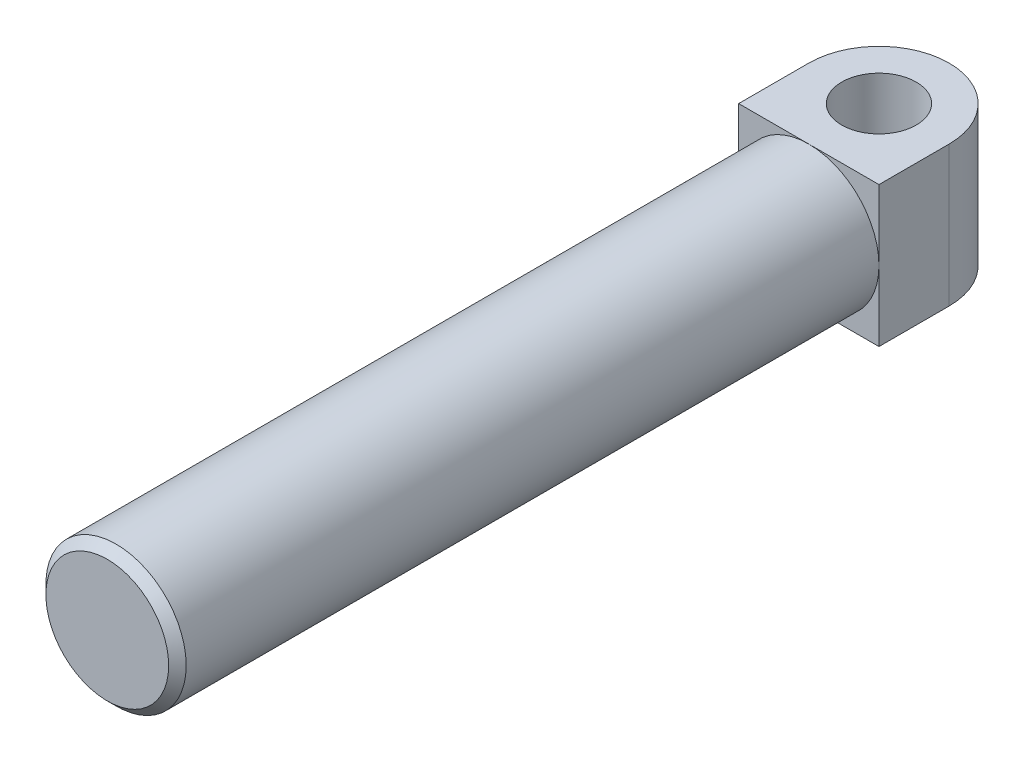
ISO-10303-21;
HEADER;
FILE_DESCRIPTION(('STEP AP214'),'2;1');
FILE_NAME('part.step','',(''),(''),'','','');
FILE_SCHEMA(('AUTOMOTIVE_DESIGN { 1 0 10303 214 1 1 1 1 }'));
ENDSEC;
DATA;
#1=APPLICATION_CONTEXT('core data for automotive mechanical design processes');
#2=APPLICATION_PROTOCOL_DEFINITION('international standard','automotive_design',2000,#1);
#3=PRODUCT_CONTEXT('',#1,'mechanical');
#4=PRODUCT('Part','Part','',(#3));
#5=PRODUCT_RELATED_PRODUCT_CATEGORY('part','',(#4));
#6=PRODUCT_DEFINITION_FORMATION('','',#4);
#7=PRODUCT_DEFINITION_CONTEXT('part definition',#1,'design');
#8=PRODUCT_DEFINITION('design','',#6,#7);
#9=PRODUCT_DEFINITION_SHAPE('','',#8);
#10=(LENGTH_UNIT() NAMED_UNIT(*) SI_UNIT(.MILLI.,.METRE.));
#11=(NAMED_UNIT(*) PLANE_ANGLE_UNIT() SI_UNIT($,.RADIAN.));
#12=(NAMED_UNIT(*) SI_UNIT($,.STERADIAN.) SOLID_ANGLE_UNIT());
#13=UNCERTAINTY_MEASURE_WITH_UNIT(LENGTH_MEASURE(1.E-05),#10,'distance_accuracy_value','');
#14=(GEOMETRIC_REPRESENTATION_CONTEXT(3) GLOBAL_UNCERTAINTY_ASSIGNED_CONTEXT((#13)) GLOBAL_UNIT_ASSIGNED_CONTEXT((#10,
#11,#12)) REPRESENTATION_CONTEXT('',''));
#15=CARTESIAN_POINT('',(0.,0.,0.));
#16=DIRECTION('',(0.,0.,1.));
#17=DIRECTION('',(1.,0.,0.));
#18=AXIS2_PLACEMENT_3D('',#15,#16,#17);
#19=CARTESIAN_POINT('',(0.,0.,254.));
#20=DIRECTION('',(0.,0.,-1.));
#21=DIRECTION('',(-1.,0.,0.));
#22=AXIS2_PLACEMENT_3D('',#19,#20,#21);
#23=CYLINDRICAL_SURFACE('',#22,25.4);
#24=CARTESIAN_POINT('',(0.,0.,250.825));
#25=DIRECTION('',(0.,0.,1.));
#26=DIRECTION('',(1.,0.,0.));
#27=AXIS2_PLACEMENT_3D('',#24,#25,#26);
#28=CIRCLE('',#27,25.4);
#29=CARTESIAN_POINT('',(25.4,0.,250.825));
#30=VERTEX_POINT('',#29);
#31=EDGE_CURVE('E11',#30,#30,#28,.F.);
#32=ORIENTED_EDGE('',*,*,#31,.T.);
#33=EDGE_LOOP('',(#32));
#34=FACE_BOUND('',#33,.T.);
#35=CARTESIAN_POINT('',(0.,0.,0.));
#36=DIRECTION('',(0.,0.,1.));
#37=DIRECTION('',(1.,0.,0.));
#38=AXIS2_PLACEMENT_3D('',#35,#36,#37);
#39=CIRCLE('',#38,25.4);
#40=CARTESIAN_POINT('',(25.4,0.,0.));
#41=VERTEX_POINT('',#40);
#42=CARTESIAN_POINT('',(0.,25.4,0.));
#43=VERTEX_POINT('',#42);
#44=EDGE_CURVE('E106',#41,#43,#39,.T.);
#45=ORIENTED_EDGE('',*,*,#44,.T.);
#46=CARTESIAN_POINT('',(-25.4,0.,0.));
#47=VERTEX_POINT('',#46);
#48=EDGE_CURVE('E134',#43,#47,#39,.T.);
#49=ORIENTED_EDGE('',*,*,#48,.T.);
#50=CARTESIAN_POINT('',(0.,-25.4,0.));
#51=VERTEX_POINT('',#50);
#52=EDGE_CURVE('E201',#47,#51,#39,.T.);
#53=ORIENTED_EDGE('',*,*,#52,.T.);
#54=EDGE_CURVE('E128',#51,#41,#39,.T.);
#55=ORIENTED_EDGE('',*,*,#54,.T.);
#56=EDGE_LOOP('',(#45,#49,#53,#55));
#57=FACE_BOUND('',#56,.T.);
#58=ADVANCED_FACE('F33',(#34,#57),#23,.T.);
#59=CARTESIAN_POINT('',(0.,0.,254.));
#60=DIRECTION('',(0.,0.,1.));
#61=DIRECTION('',(1.,0.,0.));
#62=AXIS2_PLACEMENT_3D('',#59,#60,#61);
#63=PLANE('',#62);
#64=CARTESIAN_POINT('',(0.,0.,254.));
#65=DIRECTION('',(0.,0.,1.));
#66=DIRECTION('',(1.,0.,0.));
#67=AXIS2_PLACEMENT_3D('',#64,#65,#66);
#68=CIRCLE('',#67,22.225);
#69=CARTESIAN_POINT('',(22.225,0.,254.));
#70=VERTEX_POINT('',#69);
#71=EDGE_CURVE('E41',#70,#70,#68,.T.);
#72=ORIENTED_EDGE('',*,*,#71,.T.);
#73=EDGE_LOOP('',(#72));
#74=FACE_BOUND('',#73,.T.);
#75=ADVANCED_FACE('F153',(#74),#63,.T.);
#76=CARTESIAN_POINT('',(0.,0.,0.));
#77=DIRECTION('',(0.,0.,-1.));
#78=DIRECTION('',(-1.,0.,0.));
#79=AXIS2_PLACEMENT_3D('',#76,#77,#78);
#80=PLANE('',#79);
#81=ORIENTED_EDGE('',*,*,#44,.F.);
#82=DIRECTION('',(0.,1.,0.));
#83=VECTOR('',#82,1.);
#84=CARTESIAN_POINT('',(25.4,25.4,0.));
#85=LINE('',#84,#83);
#86=CARTESIAN_POINT('',(25.4,25.4,0.));
#87=VERTEX_POINT('',#86);
#88=EDGE_CURVE('E95',#41,#87,#85,.T.);
#89=ORIENTED_EDGE('',*,*,#88,.T.);
#90=DIRECTION('',(-1.,0.,0.));
#91=VECTOR('',#90,1.);
#92=CARTESIAN_POINT('',(25.4,25.4,0.));
#93=LINE('',#92,#91);
#94=EDGE_CURVE('E104',#87,#43,#93,.T.);
#95=ORIENTED_EDGE('',*,*,#94,.T.);
#96=EDGE_LOOP('',(#81,#89,#95));
#97=FACE_BOUND('',#96,.T.);
#98=ADVANCED_FACE('F103',(#97),#80,.F.);
#99=ORIENTED_EDGE('',*,*,#48,.F.);
#100=CARTESIAN_POINT('',(-25.4,25.4,0.));
#101=VERTEX_POINT('',#100);
#102=EDGE_CURVE('E114',#43,#101,#93,.T.);
#103=ORIENTED_EDGE('',*,*,#102,.T.);
#104=DIRECTION('',(0.,-1.,0.));
#105=VECTOR('',#104,1.);
#106=CARTESIAN_POINT('',(-25.4,25.4,0.));
#107=LINE('',#106,#105);
#108=EDGE_CURVE('E118',#101,#47,#107,.T.);
#109=ORIENTED_EDGE('',*,*,#108,.T.);
#110=EDGE_LOOP('',(#99,#103,#109));
#111=FACE_BOUND('',#110,.T.);
#112=ADVANCED_FACE('F199',(#111),#80,.F.);
#113=ORIENTED_EDGE('',*,*,#52,.F.);
#114=CARTESIAN_POINT('',(-25.4,-25.4,0.));
#115=VERTEX_POINT('',#114);
#116=EDGE_CURVE('E115',#47,#115,#107,.T.);
#117=ORIENTED_EDGE('',*,*,#116,.T.);
#118=DIRECTION('',(1.,0.,0.));
#119=VECTOR('',#118,1.);
#120=CARTESIAN_POINT('',(25.4,-25.4,0.));
#121=LINE('',#120,#119);
#122=EDGE_CURVE('E99',#115,#51,#121,.T.);
#123=ORIENTED_EDGE('',*,*,#122,.T.);
#124=EDGE_LOOP('',(#113,#117,#123));
#125=FACE_BOUND('',#124,.T.);
#126=ADVANCED_FACE('F187',(#125),#80,.F.);
#127=CARTESIAN_POINT('',(25.4,25.4,-50.8));
#128=DIRECTION('',(1.,0.,0.));
#129=DIRECTION('',(0.,1.,0.));
#130=AXIS2_PLACEMENT_3D('',#127,#128,#129);
#131=PLANE('',#130);
#132=DIRECTION('',(0.,0.,1.));
#133=VECTOR('',#132,1.);
#134=CARTESIAN_POINT('',(25.4,-25.4,-50.8));
#135=LINE('',#134,#133);
#136=CARTESIAN_POINT('',(25.4,-25.4,-25.4));
#137=VERTEX_POINT('',#136);
#138=CARTESIAN_POINT('',(25.4,-25.4,0.));
#139=VERTEX_POINT('',#138);
#140=EDGE_CURVE('E126',#137,#139,#135,.T.);
#141=ORIENTED_EDGE('',*,*,#140,.F.);
#142=DIRECTION('',(0.,1.,0.));
#143=VECTOR('',#142,1.);
#144=CARTESIAN_POINT('',(25.4,25.4,-25.4));
#145=LINE('',#144,#143);
#146=CARTESIAN_POINT('',(25.4,25.4,-25.4));
#147=VERTEX_POINT('',#146);
#148=EDGE_CURVE('E56',#137,#147,#145,.T.);
#149=ORIENTED_EDGE('',*,*,#148,.T.);
#150=DIRECTION('',(0.,0.,1.));
#151=VECTOR('',#150,1.);
#152=CARTESIAN_POINT('',(25.4,25.4,-50.8));
#153=LINE('',#152,#151);
#154=EDGE_CURVE('E91',#147,#87,#153,.T.);
#155=ORIENTED_EDGE('',*,*,#154,.T.);
#156=ORIENTED_EDGE('',*,*,#88,.F.);
#157=EDGE_CURVE('E108',#139,#41,#85,.T.);
#158=ORIENTED_EDGE('',*,*,#157,.F.);
#159=EDGE_LOOP('',(#141,#149,#155,#156,#158));
#160=FACE_BOUND('',#159,.T.);
#161=ADVANCED_FACE('F93',(#160),#131,.T.);
#162=CARTESIAN_POINT('',(25.4,-25.4,-50.8));
#163=DIRECTION('',(0.,-1.,0.));
#164=DIRECTION('',(1.,0.,0.));
#165=AXIS2_PLACEMENT_3D('',#162,#163,#164);
#166=PLANE('',#165);
#167=CARTESIAN_POINT('',(0.,-25.4,-25.4));
#168=DIRECTION('',(0.,-1.,0.));
#169=DIRECTION('',(1.,0.,0.));
#170=AXIS2_PLACEMENT_3D('',#167,#168,#169);
#171=CIRCLE('',#170,13.49375);
#172=CARTESIAN_POINT('',(13.49375,-25.4,-25.4));
#173=VERTEX_POINT('',#172);
#174=EDGE_CURVE('E147',#173,#173,#171,.T.);
#175=ORIENTED_EDGE('',*,*,#174,.F.);
#176=EDGE_LOOP('',(#175));
#177=FACE_BOUND('',#176,.T.);
#178=DIRECTION('',(0.,0.,1.));
#179=VECTOR('',#178,1.);
#180=CARTESIAN_POINT('',(-25.4,-25.4,-50.8));
#181=LINE('',#180,#179);
#182=CARTESIAN_POINT('',(-25.4,-25.4,-25.4));
#183=VERTEX_POINT('',#182);
#184=EDGE_CURVE('E129',#183,#115,#181,.T.);
#185=ORIENTED_EDGE('',*,*,#184,.F.);
#186=CARTESIAN_POINT('',(0.,-25.4,-25.4));
#187=DIRECTION('',(0.,-1.,0.));
#188=DIRECTION('',(1.,0.,0.));
#189=AXIS2_PLACEMENT_3D('',#186,#187,#188);
#190=CIRCLE('',#189,25.4);
#191=CARTESIAN_POINT('',(0.,-25.4,-50.8));
#192=VERTEX_POINT('',#191);
#193=EDGE_CURVE('E139',#183,#192,#190,.T.);
#194=ORIENTED_EDGE('',*,*,#193,.T.);
#195=CARTESIAN_POINT('',(0.,-25.4,-25.4));
#196=DIRECTION('',(0.,-1.,0.));
#197=DIRECTION('',(1.,0.,0.));
#198=AXIS2_PLACEMENT_3D('',#195,#196,#197);
#199=CIRCLE('',#198,25.4);
#200=EDGE_CURVE('E137',#192,#137,#199,.T.);
#201=ORIENTED_EDGE('',*,*,#200,.T.);
#202=ORIENTED_EDGE('',*,*,#140,.T.);
#203=EDGE_CURVE('E123',#51,#139,#121,.T.);
#204=ORIENTED_EDGE('',*,*,#203,.F.);
#205=ORIENTED_EDGE('',*,*,#122,.F.);
#206=EDGE_LOOP('',(#185,#194,#201,#202,#204,#205));
#207=FACE_BOUND('',#206,.T.);
#208=ADVANCED_FACE('F206',(#177,#207),#166,.T.);
#209=CARTESIAN_POINT('',(-25.4,25.4,-50.8));
#210=DIRECTION('',(-1.,0.,0.));
#211=DIRECTION('',(0.,-1.,0.));
#212=AXIS2_PLACEMENT_3D('',#209,#210,#211);
#213=PLANE('',#212);
#214=DIRECTION('',(0.,0.,1.));
#215=VECTOR('',#214,1.);
#216=CARTESIAN_POINT('',(-25.4,25.4,-50.8));
#217=LINE('',#216,#215);
#218=CARTESIAN_POINT('',(-25.4,25.4,-25.4));
#219=VERTEX_POINT('',#218);
#220=EDGE_CURVE('E98',#219,#101,#217,.T.);
#221=ORIENTED_EDGE('',*,*,#220,.F.);
#222=DIRECTION('',(0.,-1.,0.));
#223=VECTOR('',#222,1.);
#224=CARTESIAN_POINT('',(-25.4,25.4,-25.4));
#225=LINE('',#224,#223);
#226=EDGE_CURVE('E133',#219,#183,#225,.T.);
#227=ORIENTED_EDGE('',*,*,#226,.T.);
#228=ORIENTED_EDGE('',*,*,#184,.T.);
#229=ORIENTED_EDGE('',*,*,#116,.F.);
#230=ORIENTED_EDGE('',*,*,#108,.F.);
#231=EDGE_LOOP('',(#221,#227,#228,#229,#230));
#232=FACE_BOUND('',#231,.T.);
#233=ADVANCED_FACE('F194',(#232),#213,.T.);
#234=CARTESIAN_POINT('',(25.4,25.4,-50.8));
#235=DIRECTION('',(0.,1.,0.));
#236=DIRECTION('',(-1.,0.,0.));
#237=AXIS2_PLACEMENT_3D('',#234,#235,#236);
#238=PLANE('',#237);
#239=CARTESIAN_POINT('',(0.,25.4,-25.4));
#240=DIRECTION('',(0.,1.,0.));
#241=DIRECTION('',(-1.,0.,0.));
#242=AXIS2_PLACEMENT_3D('',#239,#240,#241);
#243=CIRCLE('',#242,13.49375);
#244=CARTESIAN_POINT('',(-13.49375,25.4,-25.4));
#245=VERTEX_POINT('',#244);
#246=EDGE_CURVE('E148',#245,#245,#243,.T.);
#247=ORIENTED_EDGE('',*,*,#246,.F.);
#248=EDGE_LOOP('',(#247));
#249=FACE_BOUND('',#248,.T.);
#250=CARTESIAN_POINT('',(0.,25.4,-25.4));
#251=DIRECTION('',(0.,1.,0.));
#252=DIRECTION('',(-1.,0.,0.));
#253=AXIS2_PLACEMENT_3D('',#250,#251,#252);
#254=CIRCLE('',#253,25.4);
#255=CARTESIAN_POINT('',(0.,25.4,-50.8));
#256=VERTEX_POINT('',#255);
#257=EDGE_CURVE('E48',#147,#256,#254,.T.);
#258=ORIENTED_EDGE('',*,*,#257,.T.);
#259=CARTESIAN_POINT('',(0.,25.4,-25.4));
#260=DIRECTION('',(0.,1.,0.));
#261=DIRECTION('',(-1.,0.,0.));
#262=AXIS2_PLACEMENT_3D('',#259,#260,#261);
#263=CIRCLE('',#262,25.4);
#264=EDGE_CURVE('E142',#256,#219,#263,.T.);
#265=ORIENTED_EDGE('',*,*,#264,.T.);
#266=ORIENTED_EDGE('',*,*,#220,.T.);
#267=ORIENTED_EDGE('',*,*,#102,.F.);
#268=ORIENTED_EDGE('',*,*,#94,.F.);
#269=ORIENTED_EDGE('',*,*,#154,.F.);
#270=EDGE_LOOP('',(#258,#265,#266,#267,#268,#269));
#271=FACE_BOUND('',#270,.T.);
#272=ADVANCED_FACE('F112',(#249,#271),#238,.T.);
#273=ORIENTED_EDGE('',*,*,#54,.F.);
#274=ORIENTED_EDGE('',*,*,#203,.T.);
#275=ORIENTED_EDGE('',*,*,#157,.T.);
#276=EDGE_LOOP('',(#273,#274,#275));
#277=FACE_BOUND('',#276,.T.);
#278=ADVANCED_FACE('F180',(#277),#80,.F.);
#279=CARTESIAN_POINT('',(0.,25.4,-25.4));
#280=DIRECTION('',(0.,1.,0.));
#281=DIRECTION('',(-1.,0.,0.));
#282=AXIS2_PLACEMENT_3D('',#279,#280,#281);
#283=CYLINDRICAL_SURFACE('',#282,25.4);
#284=DIRECTION('',(0.,1.,0.));
#285=VECTOR('',#284,1.);
#286=CARTESIAN_POINT('',(0.,0.,-50.8));
#287=LINE('',#286,#285);
#288=EDGE_CURVE('E109',#256,#192,#287,.F.);
#289=ORIENTED_EDGE('',*,*,#288,.F.);
#290=ORIENTED_EDGE('',*,*,#257,.F.);
#291=ORIENTED_EDGE('',*,*,#148,.F.);
#292=ORIENTED_EDGE('',*,*,#200,.F.);
#293=EDGE_LOOP('',(#289,#290,#291,#292));
#294=FACE_BOUND('',#293,.T.);
#295=ADVANCED_FACE('F177',(#294),#283,.T.);
#296=CARTESIAN_POINT('',(0.,25.4,-25.4));
#297=DIRECTION('',(0.,-1.,0.));
#298=DIRECTION('',(1.,0.,0.));
#299=AXIS2_PLACEMENT_3D('',#296,#297,#298);
#300=CYLINDRICAL_SURFACE('',#299,25.4);
#301=ORIENTED_EDGE('',*,*,#264,.F.);
#302=ORIENTED_EDGE('',*,*,#288,.T.);
#303=ORIENTED_EDGE('',*,*,#193,.F.);
#304=ORIENTED_EDGE('',*,*,#226,.F.);
#305=EDGE_LOOP('',(#301,#302,#303,#304));
#306=FACE_BOUND('',#305,.T.);
#307=ADVANCED_FACE('F161',(#306),#300,.T.);
#308=CARTESIAN_POINT('',(0.,-31.75,-25.4));
#309=DIRECTION('',(0.,1.,0.));
#310=DIRECTION('',(0.,0.,1.));
#311=AXIS2_PLACEMENT_3D('',#308,#309,#310);
#312=CYLINDRICAL_SURFACE('',#311,13.49375);
#313=ORIENTED_EDGE('',*,*,#174,.T.);
#314=EDGE_LOOP('',(#313));
#315=FACE_BOUND('',#314,.T.);
#316=ORIENTED_EDGE('',*,*,#246,.T.);
#317=EDGE_LOOP('',(#316));
#318=FACE_BOUND('',#317,.T.);
#319=ADVANCED_FACE('F156',(#315,#318),#312,.F.);
#320=CARTESIAN_POINT('',(0.,0.,254.));
#321=DIRECTION('',(0.,0.,-1.));
#322=DIRECTION('',(-1.,0.,0.));
#323=AXIS2_PLACEMENT_3D('',#320,#321,#322);
#324=CONICAL_SURFACE('',#323,22.225,0.785398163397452);
#325=ORIENTED_EDGE('',*,*,#31,.F.);
#326=EDGE_LOOP('',(#325));
#327=FACE_BOUND('',#326,.T.);
#328=ORIENTED_EDGE('',*,*,#71,.F.);
#329=EDGE_LOOP('',(#328));
#330=FACE_BOUND('',#329,.T.);
#331=ADVANCED_FACE('F35',(#327,#330),#324,.T.);
#332=CLOSED_SHELL('',(#58,#75,#98,#112,#126,#161,#208,#233,#272,#278,#295,#307,#319,#331));
#333=MANIFOLD_SOLID_BREP('B2',#332);
#334=ADVANCED_BREP_SHAPE_REPRESENTATION('',(#18,#333),#14);
#335=SHAPE_DEFINITION_REPRESENTATION(#9,#334);
ENDSEC;
END-ISO-10303-21;
